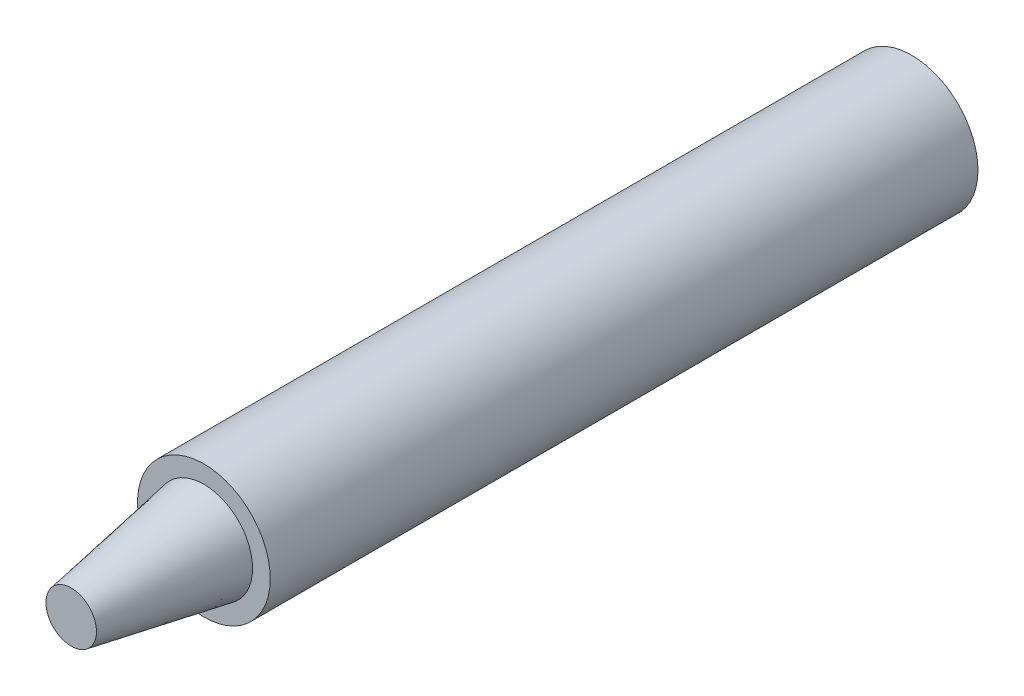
from build123d import *

# Parameters (mm, degrees)
SKETCH1_R           = 9.525
BASE_EXTRUDE_DEPTH  = 101.6
SKETCH2_R           = 6.985
BOSS_EXTRUDE1_DEPTH = 19.05
BOSS_EXTRUDE1_TAPER = 10


with BuildPart() as part:
    # Sketch1 → Base-Extrude (new body)
    with BuildSketch(Plane.XY):
        Circle(SKETCH1_R)
    extrude(amount=BASE_EXTRUDE_DEPTH)

    # Sketch2 → Boss-Extrude1 (add)
    with BuildSketch(Plane.XY.offset(101.6)):
        Circle(SKETCH2_R)
    extrude(amount=BOSS_EXTRUDE1_DEPTH, taper=BOSS_EXTRUDE1_TAPER)


solid = part.part
